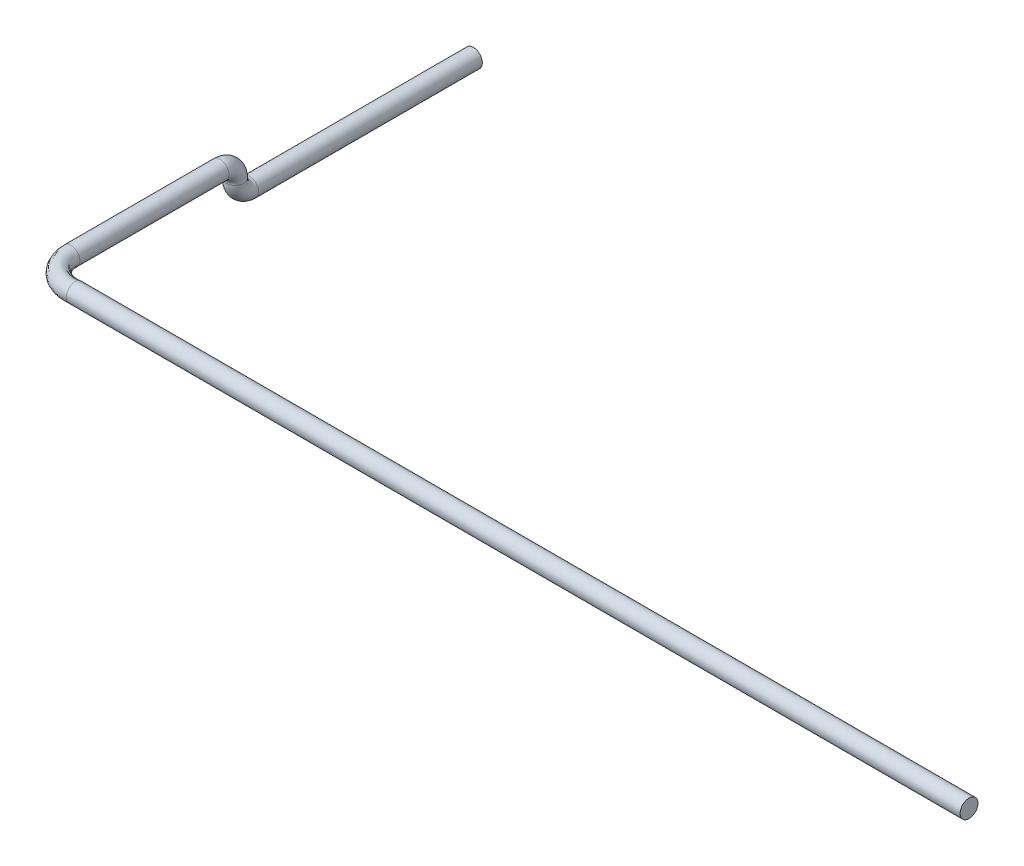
ISO-10303-21;
HEADER;
FILE_DESCRIPTION(('STEP AP214'),'2;1');
FILE_NAME('part.step','',(''),(''),'','','');
FILE_SCHEMA(('AUTOMOTIVE_DESIGN { 1 0 10303 214 1 1 1 1 }'));
ENDSEC;
DATA;
#1=APPLICATION_CONTEXT('core data for automotive mechanical design processes');
#2=APPLICATION_PROTOCOL_DEFINITION('international standard','automotive_design',2000,#1);
#3=PRODUCT_CONTEXT('',#1,'mechanical');
#4=PRODUCT('Part','Part','',(#3));
#5=PRODUCT_RELATED_PRODUCT_CATEGORY('part','',(#4));
#6=PRODUCT_DEFINITION_FORMATION('','',#4);
#7=PRODUCT_DEFINITION_CONTEXT('part definition',#1,'design');
#8=PRODUCT_DEFINITION('design','',#6,#7);
#9=PRODUCT_DEFINITION_SHAPE('','',#8);
#10=(LENGTH_UNIT() NAMED_UNIT(*) SI_UNIT(.MILLI.,.METRE.));
#11=(NAMED_UNIT(*) PLANE_ANGLE_UNIT() SI_UNIT($,.RADIAN.));
#12=(NAMED_UNIT(*) SI_UNIT($,.STERADIAN.) SOLID_ANGLE_UNIT());
#13=UNCERTAINTY_MEASURE_WITH_UNIT(LENGTH_MEASURE(1.E-05),#10,'distance_accuracy_value','');
#14=(GEOMETRIC_REPRESENTATION_CONTEXT(3) GLOBAL_UNCERTAINTY_ASSIGNED_CONTEXT((#13)) GLOBAL_UNIT_ASSIGNED_CONTEXT((#10,
#11,#12)) REPRESENTATION_CONTEXT('',''));
#15=CARTESIAN_POINT('',(0.,0.,0.));
#16=DIRECTION('',(0.,0.,1.));
#17=DIRECTION('',(1.,0.,0.));
#18=AXIS2_PLACEMENT_3D('',#15,#16,#17);
#19=CARTESIAN_POINT('',(-38.1,50.8,88.9));
#20=DIRECTION('',(0.,0.,-1.));
#21=DIRECTION('',(-1.,0.,0.));
#22=AXIS2_PLACEMENT_3D('',#19,#20,#21);
#23=CYLINDRICAL_SURFACE('',#22,3.81);
#24=CARTESIAN_POINT('',(-38.1,50.8,0.));
#25=DIRECTION('',(0.,0.,1.));
#26=DIRECTION('',(1.,0.,0.));
#27=AXIS2_PLACEMENT_3D('',#24,#25,#26);
#28=CIRCLE('',#27,3.81);
#29=CARTESIAN_POINT('',(-34.29,50.8,0.));
#30=VERTEX_POINT('',#29);
#31=EDGE_CURVE('E10',#30,#30,#28,.T.);
#32=ORIENTED_EDGE('',*,*,#31,.T.);
#33=EDGE_LOOP('',(#32));
#34=FACE_BOUND('',#33,.T.);
#35=CARTESIAN_POINT('',(-38.1,50.8,95.25));
#36=DIRECTION('',(0.,0.,1.));
#37=DIRECTION('',(1.,0.,0.));
#38=AXIS2_PLACEMENT_3D('',#35,#36,#37);
#39=CIRCLE('',#38,3.81);
#40=CARTESIAN_POINT('',(-34.29,50.8,95.25));
#41=VERTEX_POINT('',#40);
#42=EDGE_CURVE('E43',#41,#41,#39,.T.);
#43=ORIENTED_EDGE('',*,*,#42,.F.);
#44=EDGE_LOOP('',(#43));
#45=FACE_BOUND('',#44,.T.);
#46=ADVANCED_FACE('F29',(#34,#45),#23,.T.);
#47=CARTESIAN_POINT('',(-38.1,50.8,0.));
#48=DIRECTION('',(0.,0.,1.));
#49=DIRECTION('',(1.,0.,0.));
#50=AXIS2_PLACEMENT_3D('',#47,#48,#49);
#51=PLANE('',#50);
#52=ORIENTED_EDGE('',*,*,#31,.F.);
#53=EDGE_LOOP('',(#52));
#54=FACE_BOUND('',#53,.T.);
#55=ADVANCED_FACE('F81',(#54),#51,.F.);
#56=CARTESIAN_POINT('',(-38.1,63.5,107.95));
#57=DIRECTION('',(0.,0.,1.));
#58=DIRECTION('',(1.,0.,0.));
#59=AXIS2_PLACEMENT_3D('',#56,#57,#58);
#60=CYLINDRICAL_SURFACE('',#59,3.81);
#61=CARTESIAN_POINT('',(-38.1,63.5,107.95));
#62=DIRECTION('',(0.,0.,1.));
#63=DIRECTION('',(1.,0.,0.));
#64=AXIS2_PLACEMENT_3D('',#61,#62,#63);
#65=CIRCLE('',#64,3.81);
#66=CARTESIAN_POINT('',(-38.1,67.31,107.95));
#67=VERTEX_POINT('',#66);
#68=EDGE_CURVE('E35',#67,#67,#65,.T.);
#69=ORIENTED_EDGE('',*,*,#68,.T.);
#70=EDGE_LOOP('',(#69));
#71=FACE_BOUND('',#70,.T.);
#72=CARTESIAN_POINT('',(-38.1,63.5,171.45));
#73=DIRECTION('',(0.,0.,1.));
#74=DIRECTION('',(1.,0.,0.));
#75=AXIS2_PLACEMENT_3D('',#72,#73,#74);
#76=CIRCLE('',#75,3.81);
#77=CARTESIAN_POINT('',(-34.29,63.5,171.45));
#78=VERTEX_POINT('',#77);
#79=EDGE_CURVE('E48',#78,#78,#76,.T.);
#80=ORIENTED_EDGE('',*,*,#79,.F.);
#81=EDGE_LOOP('',(#80));
#82=FACE_BOUND('',#81,.T.);
#83=ADVANCED_FACE('F85',(#71,#82),#60,.T.);
#84=CARTESIAN_POINT('',(-38.1,57.15,107.95));
#85=DIRECTION('',(1.,0.,0.));
#86=DIRECTION('',(0.,0.,-1.));
#87=AXIS2_PLACEMENT_3D('',#84,#85,#86);
#88=TOROIDAL_SURFACE('',#87,6.34999999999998,3.81);
#89=CARTESIAN_POINT('',(-38.1,57.15,101.6));
#90=DIRECTION('',(0.,1.,0.));
#91=DIRECTION('',(1.,0.,0.));
#92=AXIS2_PLACEMENT_3D('',#89,#90,#91);
#93=CIRCLE('',#92,3.81);
#94=CARTESIAN_POINT('',(-38.1,57.15,97.79));
#95=VERTEX_POINT('',#94);
#96=EDGE_CURVE('E39',#95,#95,#93,.T.);
#97=CARTESIAN_POINT('',(-38.1,57.15,107.95));
#98=DIRECTION('',(1.,0.,0.));
#99=DIRECTION('',(0.,0.,-1.));
#100=AXIS2_PLACEMENT_3D('',#97,#98,#99);
#101=CIRCLE('',#100,10.16);
#102=EDGE_CURVE('',#95,#67,#101,.T.);
#103=ORIENTED_EDGE('',*,*,#96,.T.);
#104=ORIENTED_EDGE('',*,*,#68,.F.);
#105=ORIENTED_EDGE('',*,*,#102,.T.);
#106=ORIENTED_EDGE('',*,*,#102,.F.);
#107=EDGE_LOOP('',(#103,#105,#104,#106));
#108=FACE_BOUND('',#107,.T.);
#109=ADVANCED_FACE('F92',(#108),#88,.T.);
#110=CARTESIAN_POINT('',(-38.1,57.15,95.25));
#111=DIRECTION('',(-1.,0.,0.));
#112=DIRECTION('',(0.,0.,1.));
#113=AXIS2_PLACEMENT_3D('',#110,#111,#112);
#114=TOROIDAL_SURFACE('',#113,6.35,3.81);
#115=ORIENTED_EDGE('',*,*,#42,.T.);
#116=EDGE_LOOP('',(#115));
#117=FACE_BOUND('',#116,.T.);
#118=ORIENTED_EDGE('',*,*,#96,.F.);
#119=EDGE_LOOP('',(#118));
#120=FACE_BOUND('',#119,.T.);
#121=ADVANCED_FACE('F77',(#117,#120),#114,.T.);
#122=CARTESIAN_POINT('',(-34.29,63.5,171.45));
#123=CARTESIAN_POINT('',(-34.29,63.5,172.200909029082));
#124=CARTESIAN_POINT('',(-34.198685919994,63.5,172.902802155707));
#125=CARTESIAN_POINT('',(-33.8110653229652,63.5,174.472357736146));
#126=CARTESIAN_POINT('',(-33.2326050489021,63.5,175.721213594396));
#127=CARTESIAN_POINT('',(-32.4545829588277,63.5,176.925102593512));
#128=CARTESIAN_POINT('',(-31.4940518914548,63.5,177.978781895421));
#129=CARTESIAN_POINT('',(-30.3913606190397,63.5,178.845811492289));
#130=CARTESIAN_POINT('',(-29.1719004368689,63.5,179.540778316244));
#131=CARTESIAN_POINT('',(-27.8862755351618,63.5000000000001,180.027391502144));
#132=CARTESIAN_POINT('',(-26.5724681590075,63.5000000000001,180.287339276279));
#133=CARTESIAN_POINT('',(-25.4389641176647,63.4999999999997,180.366234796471));
#134=CARTESIAN_POINT('',(-24.6226695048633,63.5000000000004,180.310603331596));
#135=CARTESIAN_POINT('',(-24.1107780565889,63.5000000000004,180.24898895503));
#136=CARTESIAN_POINT('',(-34.29,71.12,171.45));
#137=CARTESIAN_POINT('',(-34.29,71.12,172.876727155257));
#138=CARTESIAN_POINT('',(-34.1986872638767,71.12,172.605287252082));
#139=CARTESIAN_POINT('',(-33.8110610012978,71.12,174.544921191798));
#140=CARTESIAN_POINT('',(-33.2326195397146,71.12,175.703953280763));
#141=CARTESIAN_POINT('',(-32.4545287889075,71.12,176.930647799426));
#142=CARTESIAN_POINT('',(-31.4942902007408,71.12,177.977398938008));
#143=CARTESIAN_POINT('',(-30.3906242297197,71.12,178.846032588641));
#144=CARTESIAN_POINT('',(-29.1745826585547,71.12,179.540996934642));
#145=CARTESIAN_POINT('',(-27.8739946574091,71.1200000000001,180.025938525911));
#146=CARTESIAN_POINT('',(-26.60688770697,71.1200000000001,180.291477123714));
#147=CARTESIAN_POINT('',(-25.3327641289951,71.1199999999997,180.353453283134));
#148=CARTESIAN_POINT('',(-24.856928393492,71.1200000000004,180.338800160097));
#149=CARTESIAN_POINT('',(-24.1107780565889,71.1200000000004,180.248988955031));
#150=CARTESIAN_POINT('',(-41.91,71.12,171.45));
#151=CARTESIAN_POINT('',(-41.91,71.12,172.876727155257));
#152=CARTESIAN_POINT('',(-41.7404192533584,71.12,174.133894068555));
#153=CARTESIAN_POINT('',(-41.0205417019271,71.12,177.06640452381));
#154=CARTESIAN_POINT('',(-39.9462939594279,71.12,179.38143511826));
#155=CARTESIAN_POINT('',(-38.5012657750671,71.12,181.618299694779));
#156=CARTESIAN_POINT('',(-36.7179762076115,71.1200000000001,183.574867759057));
#157=CARTESIAN_POINT('',(-34.6682752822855,71.12,185.184925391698));
#158=CARTESIAN_POINT('',(-32.4100370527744,71.12,186.47633754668));
#159=CARTESIAN_POINT('',(-29.9941135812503,71.12,187.376643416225));
#160=CARTESIAN_POINT('',(-27.642618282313,71.1199999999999,187.870046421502));
#161=CARTESIAN_POINT('',(-25.2712599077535,71.1200000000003,187.984515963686));
#162=CARTESIAN_POINT('',(-24.3999826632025,71.1199999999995,187.958800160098));
#163=CARTESIAN_POINT('',(-23.6538323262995,71.1199999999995,187.868988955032));
#164=CARTESIAN_POINT('',(-41.91,63.5,171.45));
#165=CARTESIAN_POINT('',(-41.91,63.5,172.53881809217));
#166=CARTESIAN_POINT('',(-41.7404185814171,63.5,174.282651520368));
#167=CARTESIAN_POINT('',(-41.0205438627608,63.5,177.030122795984));
#168=CARTESIAN_POINT('',(-39.9462867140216,63.5,179.390065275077));
#169=CARTESIAN_POINT('',(-38.5012928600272,63.5,181.615527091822));
#170=CARTESIAN_POINT('',(-36.7178570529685,63.5,183.575559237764));
#171=CARTESIAN_POINT('',(-34.6686434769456,63.5,185.184814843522));
#172=CARTESIAN_POINT('',(-32.4086959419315,63.5,186.476228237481));
#173=CARTESIAN_POINT('',(-30.0002540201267,63.5,187.377369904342));
#174=CARTESIAN_POINT('',(-27.6254085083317,63.4999999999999,187.867977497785));
#175=CARTESIAN_POINT('',(-25.3243599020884,63.5000000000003,187.990906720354));
#176=CARTESIAN_POINT('',(-24.2828532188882,63.4999999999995,187.944701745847));
#177=CARTESIAN_POINT('',(-23.6538323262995,63.4999999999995,187.868988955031));
#178=CARTESIAN_POINT('',(-41.91,55.88,171.45));
#179=CARTESIAN_POINT('',(-41.91,55.88,172.200909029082));
#180=CARTESIAN_POINT('',(-41.7404179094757,55.88,174.43140897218));
#181=CARTESIAN_POINT('',(-41.0205460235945,55.8800000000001,176.993841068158));
#182=CARTESIAN_POINT('',(-39.9462794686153,55.88,179.398695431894));
#183=CARTESIAN_POINT('',(-38.5013199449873,55.88,181.612754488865));
#184=CARTESIAN_POINT('',(-36.7177378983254,55.88,183.57625071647));
#185=CARTESIAN_POINT('',(-34.6690116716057,55.88,185.184704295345));
#186=CARTESIAN_POINT('',(-32.4073548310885,55.88,186.476118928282));
#187=CARTESIAN_POINT('',(-30.0063944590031,55.88,187.378096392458));
#188=CARTESIAN_POINT('',(-27.6081987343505,55.8799999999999,187.865908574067));
#189=CARTESIAN_POINT('',(-25.3774598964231,55.8800000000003,187.997297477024));
#190=CARTESIAN_POINT('',(-24.1657237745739,55.8799999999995,187.930603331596));
#191=CARTESIAN_POINT('',(-23.6538323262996,55.8799999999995,187.86898895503));
#192=CARTESIAN_POINT('',(-34.29,55.88,171.45));
#193=CARTESIAN_POINT('',(-34.29,55.88,171.525090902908));
#194=CARTESIAN_POINT('',(-34.1986845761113,55.88,173.200317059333));
#195=CARTESIAN_POINT('',(-33.8110696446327,55.88,174.399794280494));
#196=CARTESIAN_POINT('',(-33.2325905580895,55.88,175.738473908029));
#197=CARTESIAN_POINT('',(-32.4546371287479,55.88,176.919557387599));
#198=CARTESIAN_POINT('',(-31.4938135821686,55.88,177.980164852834));
#199=CARTESIAN_POINT('',(-30.3920970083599,55.88,178.845590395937));
#200=CARTESIAN_POINT('',(-29.169218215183,55.88,179.540559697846));
#201=CARTESIAN_POINT('',(-27.8985564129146,55.88,180.028844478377));
#202=CARTESIAN_POINT('',(-26.5380486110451,55.8800000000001,180.283201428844));
#203=CARTESIAN_POINT('',(-25.5451641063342,55.8799999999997,180.379016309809));
#204=CARTESIAN_POINT('',(-24.3884106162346,55.8800000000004,180.282406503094));
#205=CARTESIAN_POINT('',(-24.110778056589,55.8800000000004,180.248988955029));
#206=CARTESIAN_POINT('',(-34.29,63.5,171.45));
#207=CARTESIAN_POINT('',(-34.29,63.5,172.200909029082));
#208=CARTESIAN_POINT('',(-34.198685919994,63.5,172.902802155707));
#209=CARTESIAN_POINT('',(-33.8110653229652,63.5,174.472357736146));
#210=CARTESIAN_POINT('',(-33.2326050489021,63.5,175.721213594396));
#211=CARTESIAN_POINT('',(-32.4545829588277,63.5,176.925102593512));
#212=CARTESIAN_POINT('',(-31.4940518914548,63.5,177.978781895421));
#213=CARTESIAN_POINT('',(-30.3913606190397,63.5,178.845811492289));
#214=CARTESIAN_POINT('',(-29.1719004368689,63.5,179.540778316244));
#215=CARTESIAN_POINT('',(-27.8862755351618,63.5000000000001,180.027391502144));
#216=CARTESIAN_POINT('',(-26.5724681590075,63.5000000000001,180.287339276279));
#217=CARTESIAN_POINT('',(-25.4389641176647,63.4999999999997,180.366234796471));
#218=CARTESIAN_POINT('',(-24.6226695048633,63.5000000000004,180.310603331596));
#219=CARTESIAN_POINT('',(-24.1107780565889,63.5000000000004,180.24898895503));
#220=(BOUNDED_SURFACE() B_SPLINE_SURFACE(3,3,((#122,#123,#124,#125,#126,#127,#128,#129,#130,
#131,#132,#133,#134,#135),(#136,#137,#138,#139,#140,#141,#142,#143,#144,#145,#146,#147,#148,
#149),(#150,#151,#152,#153,#154,#155,#156,#157,#158,#159,#160,#161,#162,#163),(#164,#165,#166,
#167,#168,#169,#170,#171,#172,#173,#174,#175,#176,#177),(#178,#179,#180,#181,#182,#183,#184,
#185,#186,#187,#188,#189,#190,#191),(#192,#193,#194,#195,#196,#197,#198,#199,#200,#201,#202,
#203,#204,#205),(#206,#207,#208,#209,#210,#211,#212,#213,#214,#215,#216,#217,#218,#219)),
.UNSPECIFIED.,.T.,.F.,.F.) B_SPLINE_SURFACE_WITH_KNOTS((4,3,4),(4,1,1,1,1,1,1,1,1,1,1,4),(0.,
0.5,1.),(0.,0.104863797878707,0.204277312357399,0.297368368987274,0.383680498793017,
0.488015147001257,0.580596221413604,0.66234425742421,0.767081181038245,0.853945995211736,
0.926414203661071,1.),
.UNSPECIFIED.) GEOMETRIC_REPRESENTATION_ITEM() RATIONAL_B_SPLINE_SURFACE(((1.,1.,1.,1.,1.,1.,1.,
1.,1.,1.,1.,1.,1.,1.),(0.333333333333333,0.333333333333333,0.333333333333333,0.333333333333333,
0.333333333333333,0.333333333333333,0.333333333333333,0.333333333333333,0.333333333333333,
0.333333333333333,0.333333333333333,0.333333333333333,0.333333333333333,0.333333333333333),
(0.333333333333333,0.333333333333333,0.333333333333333,0.333333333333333,0.333333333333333,
0.333333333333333,0.333333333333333,0.333333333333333,0.333333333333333,0.333333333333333,
0.333333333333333,0.333333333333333,0.333333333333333,0.333333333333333),(1.,1.,1.,1.,1.,1.,1.,
1.,1.,1.,1.,1.,1.,1.),(0.333333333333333,0.333333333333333,0.333333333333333,0.333333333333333,
0.333333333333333,0.333333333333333,0.333333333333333,0.333333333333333,0.333333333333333,
0.333333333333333,0.333333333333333,0.333333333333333,0.333333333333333,0.333333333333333),
(0.333333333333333,0.333333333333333,0.333333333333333,0.333333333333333,0.333333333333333,
0.333333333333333,0.333333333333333,0.333333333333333,0.333333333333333,0.333333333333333,
0.333333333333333,0.333333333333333,0.333333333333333,0.333333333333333),(1.,1.,1.,1.,1.,1.,1.,
1.,1.,1.,1.,1.,1.,1.))) REPRESENTATION_ITEM('') SURFACE());
#221=CARTESIAN_POINT('',(-24.1107780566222,63.5000000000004,180.24898895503));
#222=CARTESIAN_POINT('',(-24.1107780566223,55.8800000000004,180.248988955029));
#223=CARTESIAN_POINT('',(-23.6538323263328,55.8799999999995,187.86898895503));
#224=CARTESIAN_POINT('',(-23.6538323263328,63.4999999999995,187.868988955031));
#225=CARTESIAN_POINT('',(-23.6538323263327,71.1199999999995,187.868988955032));
#226=CARTESIAN_POINT('',(-24.1107780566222,71.1200000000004,180.248988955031));
#227=CARTESIAN_POINT('',(-24.1107780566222,63.5000000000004,180.24898895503));
#228=(BOUNDED_CURVE() B_SPLINE_CURVE(3,(#221,#222,#223,#224,#225,#226,#227),.UNSPECIFIED.,.T.,
.F.) B_SPLINE_CURVE_WITH_KNOTS((4,3,4),(0.,0.5,1.),
.UNSPECIFIED.) CURVE() GEOMETRIC_REPRESENTATION_ITEM() RATIONAL_B_SPLINE_CURVE((1.,
0.333333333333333,0.333333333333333,1.,0.333333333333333,0.333333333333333,1.)) REPRESENTATION_ITEM(''));
#229=CARTESIAN_POINT('',(-24.1107780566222,63.5000000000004,180.24898895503));
#230=VERTEX_POINT('',#229);
#231=EDGE_CURVE('E54',#230,#230,#228,.T.);
#232=ORIENTED_EDGE('',*,*,#79,.T.);
#233=EDGE_LOOP('',(#232));
#234=FACE_BOUND('',#233,.T.);
#235=ORIENTED_EDGE('',*,*,#231,.T.);
#236=EDGE_LOOP('',(#235));
#237=FACE_BOUND('',#236,.T.);
#238=ADVANCED_FACE('F63',(#234,#237),#220,.T.);
#239=CARTESIAN_POINT('',(357.117694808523,63.4999999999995,187.868988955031));
#240=DIRECTION('',(1.,0.,0.));
#241=DIRECTION('',(0.,0.,-1.));
#242=AXIS2_PLACEMENT_3D('',#239,#240,#241);
#243=PLANE('',#242);
#244=CARTESIAN_POINT('',(357.117694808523,63.5,184.05898895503));
#245=DIRECTION('',(1.,0.,0.));
#246=DIRECTION('',(0.,0.,-1.));
#247=AXIS2_PLACEMENT_3D('',#244,#245,#246);
#248=CIRCLE('',#247,3.8100000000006);
#249=CARTESIAN_POINT('',(357.117694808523,63.5,180.24898895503));
#250=VERTEX_POINT('',#249);
#251=EDGE_CURVE('E51',#250,#250,#248,.T.);
#252=ORIENTED_EDGE('',*,*,#251,.T.);
#253=EDGE_LOOP('',(#252));
#254=FACE_BOUND('',#253,.T.);
#255=ADVANCED_FACE('F68',(#254),#243,.T.);
#256=CARTESIAN_POINT('',(-24.1107780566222,63.5000000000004,180.24898895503));
#257=CARTESIAN_POINT('',(357.117694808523,63.5000000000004,180.24898895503));
#258=CARTESIAN_POINT('',(-24.1107780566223,55.8800000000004,180.248988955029));
#259=CARTESIAN_POINT('',(357.117694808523,55.8800000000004,180.248988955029));
#260=CARTESIAN_POINT('',(-23.6538323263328,55.8799999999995,187.86898895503));
#261=CARTESIAN_POINT('',(357.117694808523,55.8799999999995,187.86898895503));
#262=CARTESIAN_POINT('',(-23.6538323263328,63.4999999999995,187.868988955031));
#263=CARTESIAN_POINT('',(357.117694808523,63.4999999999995,187.868988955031));
#264=CARTESIAN_POINT('',(-23.6538323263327,71.1199999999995,187.868988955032));
#265=CARTESIAN_POINT('',(357.117694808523,71.1199999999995,187.868988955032));
#266=CARTESIAN_POINT('',(-24.1107780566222,71.1200000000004,180.248988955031));
#267=CARTESIAN_POINT('',(357.117694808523,71.1200000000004,180.248988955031));
#268=CARTESIAN_POINT('',(-24.1107780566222,63.5000000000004,180.24898895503));
#269=CARTESIAN_POINT('',(357.117694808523,63.5000000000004,180.24898895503));
#270=(BOUNDED_SURFACE() B_SPLINE_SURFACE(3,1,((#256,#257),(#258,#259),(#260,#261),(#262,#263),
(#264,#265),(#266,#267),(#268,#269)),.UNSPECIFIED.,.T.,.F.,.F.) B_SPLINE_SURFACE_WITH_KNOTS((4,
3,4),(2,2),(0.,0.5,1.),(0.,1.),
.UNSPECIFIED.) GEOMETRIC_REPRESENTATION_ITEM() RATIONAL_B_SPLINE_SURFACE(((1.,1.),
(0.333333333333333,0.333333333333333),(0.333333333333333,0.333333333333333),(1.,1.),
(0.333333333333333,0.333333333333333),(0.333333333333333,0.333333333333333),(1.,1.))) REPRESENTATION_ITEM('') SURFACE());
#271=ORIENTED_EDGE('',*,*,#231,.F.);
#272=EDGE_LOOP('',(#271));
#273=FACE_BOUND('',#272,.T.);
#274=ORIENTED_EDGE('',*,*,#251,.F.);
#275=EDGE_LOOP('',(#274));
#276=FACE_BOUND('',#275,.T.);
#277=ADVANCED_FACE('F65',(#273,#276),#270,.F.);
#278=CLOSED_SHELL('',(#46,#55,#83,#109,#121,#238,#255,#277));
#279=MANIFOLD_SOLID_BREP('B2',#278);
#280=ADVANCED_BREP_SHAPE_REPRESENTATION('',(#18,#279),#14);
#281=SHAPE_DEFINITION_REPRESENTATION(#9,#280);
ENDSEC;
END-ISO-10303-21;
